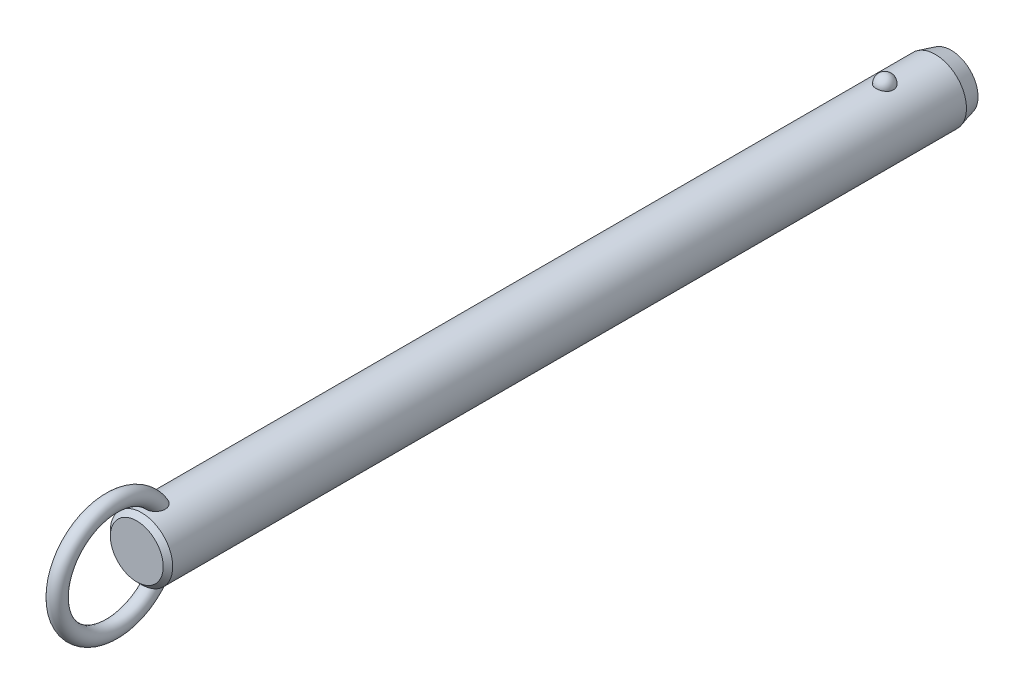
ISO-10303-21;
HEADER;
FILE_DESCRIPTION(('STEP AP214'),'2;1');
FILE_NAME('part.step','',(''),(''),'','','');
FILE_SCHEMA(('AUTOMOTIVE_DESIGN { 1 0 10303 214 1 1 1 1 }'));
ENDSEC;
DATA;
#1=APPLICATION_CONTEXT('core data for automotive mechanical design processes');
#2=APPLICATION_PROTOCOL_DEFINITION('international standard','automotive_design',2000,#1);
#3=PRODUCT_CONTEXT('',#1,'mechanical');
#4=PRODUCT('Part','Part','',(#3));
#5=PRODUCT_RELATED_PRODUCT_CATEGORY('part','',(#4));
#6=PRODUCT_DEFINITION_FORMATION('','',#4);
#7=PRODUCT_DEFINITION_CONTEXT('part definition',#1,'design');
#8=PRODUCT_DEFINITION('design','',#6,#7);
#9=PRODUCT_DEFINITION_SHAPE('','',#8);
#10=(LENGTH_UNIT() NAMED_UNIT(*) SI_UNIT(.MILLI.,.METRE.));
#11=(NAMED_UNIT(*) PLANE_ANGLE_UNIT() SI_UNIT($,.RADIAN.));
#12=(NAMED_UNIT(*) SI_UNIT($,.STERADIAN.) SOLID_ANGLE_UNIT());
#13=UNCERTAINTY_MEASURE_WITH_UNIT(LENGTH_MEASURE(1.E-05),#10,'distance_accuracy_value','');
#14=(GEOMETRIC_REPRESENTATION_CONTEXT(3) GLOBAL_UNCERTAINTY_ASSIGNED_CONTEXT((#13)) GLOBAL_UNIT_ASSIGNED_CONTEXT((#10,
#11,#12)) REPRESENTATION_CONTEXT('',''));
#15=CARTESIAN_POINT('',(0.,0.,0.));
#16=DIRECTION('',(0.,0.,1.));
#17=DIRECTION('',(1.,0.,0.));
#18=AXIS2_PLACEMENT_3D('',#15,#16,#17);
#19=CARTESIAN_POINT('',(0.,0.,177.8));
#20=DIRECTION('',(0.,0.,-1.));
#21=DIRECTION('',(-1.,0.,0.));
#22=AXIS2_PLACEMENT_3D('',#19,#20,#21);
#23=CYLINDRICAL_SURFACE('',#22,7.9);
#24=CARTESIAN_POINT('',(2.1785689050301,7.59367088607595,-2.20000000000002));
#25=CARTESIAN_POINT('',(2.17856679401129,7.59367269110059,-2.07701843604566));
#26=CARTESIAN_POINT('',(2.16853481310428,7.59657145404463,-1.95401006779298));
#27=CARTESIAN_POINT('',(2.12864689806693,7.607843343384,-1.71147811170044));
#28=CARTESIAN_POINT('',(2.09878338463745,7.61621856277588,-1.5919558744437));
#29=CARTESIAN_POINT('',(2.0199931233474,7.63749180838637,-1.35985638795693));
#30=CARTESIAN_POINT('',(1.97107475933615,7.6503878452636,-1.24727610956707));
#31=CARTESIAN_POINT('',(1.85539377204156,7.67926115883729,-1.03213234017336));
#32=CARTESIAN_POINT('',(1.78863158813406,7.69523835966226,-0.929568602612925));
#33=CARTESIAN_POINT('',(1.63856494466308,7.7285848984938,-0.73678633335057));
#34=CARTESIAN_POINT('',(1.55518140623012,7.7459606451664,-0.646630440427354));
#35=CARTESIAN_POINT('',(1.37422937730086,7.78009978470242,-0.481747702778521));
#36=CARTESIAN_POINT('',(1.27666086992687,7.79686317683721,-0.407020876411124));
#37=CARTESIAN_POINT('',(1.07024728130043,7.82786153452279,-0.275278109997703));
#38=CARTESIAN_POINT('',(0.961434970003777,7.84210353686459,-0.218212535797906));
#39=CARTESIAN_POINT('',(0.735351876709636,7.86652194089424,-0.123146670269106));
#40=CARTESIAN_POINT('',(0.618082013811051,7.87669878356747,-0.0851443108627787));
#41=CARTESIAN_POINT('',(0.380637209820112,7.89170521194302,-0.0298158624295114));
#42=CARTESIAN_POINT('',(0.260550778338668,7.89662650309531,-0.0121347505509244));
#43=CARTESIAN_POINT('',(0.0190117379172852,7.90090003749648,0.00324379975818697));
#44=CARTESIAN_POINT('',(-0.102440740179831,7.90025280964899,0.000943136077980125));
#45=CARTESIAN_POINT('',(-0.341452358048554,7.89351056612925,-0.0233955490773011));
#46=CARTESIAN_POINT('',(-0.459042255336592,7.88749257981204,-0.0451545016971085));
#47=CARTESIAN_POINT('',(-0.688796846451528,7.87075812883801,-0.107408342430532));
#48=CARTESIAN_POINT('',(-0.800961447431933,7.86004158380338,-0.14790355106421));
#49=CARTESIAN_POINT('',(-1.01743634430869,7.83497131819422,-0.246799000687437));
#50=CARTESIAN_POINT('',(-1.12169791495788,7.82059709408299,-0.305300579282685));
#51=CARTESIAN_POINT('',(-1.31891765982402,7.78976470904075,-0.43854939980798));
#52=CARTESIAN_POINT('',(-1.41187469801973,7.77330633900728,-0.513298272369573));
#53=CARTESIAN_POINT('',(-1.58577142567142,7.73972434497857,-0.678622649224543));
#54=CARTESIAN_POINT('',(-1.66645140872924,7.72259402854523,-0.769470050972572));
#55=CARTESIAN_POINT('',(-1.81161503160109,7.68983776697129,-0.963538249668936));
#56=CARTESIAN_POINT('',(-1.87609753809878,7.6742119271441,-1.0667599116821));
#57=CARTESIAN_POINT('',(-1.98790138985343,7.6460202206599,-1.28401170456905));
#58=CARTESIAN_POINT('',(-2.03501994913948,7.63349104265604,-1.39815107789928));
#59=CARTESIAN_POINT('',(-2.10986724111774,7.6131449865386,-1.6330178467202));
#60=CARTESIAN_POINT('',(-2.1375965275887,7.60532797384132,-1.75374505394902));
#61=CARTESIAN_POINT('',(-2.17289256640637,7.5953195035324,-1.99782562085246));
#62=CARTESIAN_POINT('',(-2.18054294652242,7.59310471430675,-2.12116592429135));
#63=CARTESIAN_POINT('',(-2.17572919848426,7.59448538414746,-2.36741799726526));
#64=CARTESIAN_POINT('',(-2.1632656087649,7.59808068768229,-2.49032977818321));
#65=CARTESIAN_POINT('',(-2.11865035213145,7.61064035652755,-2.73161015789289));
#66=CARTESIAN_POINT('',(-2.08659579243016,7.61957823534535,-2.84999812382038));
#67=CARTESIAN_POINT('',(-2.00367799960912,7.64179982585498,-3.07955956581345));
#68=CARTESIAN_POINT('',(-1.9528140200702,7.65508371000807,-3.19073275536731));
#69=CARTESIAN_POINT('',(-1.83321113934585,7.68460381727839,-3.40337899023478));
#70=CARTESIAN_POINT('',(-1.76437735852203,7.70085556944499,-3.5047965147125));
#71=CARTESIAN_POINT('',(-1.61069526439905,7.73445734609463,-3.69446912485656));
#72=CARTESIAN_POINT('',(-1.52584634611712,7.75180741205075,-3.78272371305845));
#73=CARTESIAN_POINT('',(-1.34198059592,7.78574608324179,-3.94393987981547));
#74=CARTESIAN_POINT('',(-1.24291308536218,7.80233167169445,-4.01684434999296));
#75=CARTESIAN_POINT('',(-1.03352039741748,7.83281625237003,-4.14489386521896));
#76=CARTESIAN_POINT('',(-0.92319600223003,7.84671543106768,-4.20004014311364));
#77=CARTESIAN_POINT('',(-0.695822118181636,7.87011575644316,-4.29042017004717));
#78=CARTESIAN_POINT('',(-0.578872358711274,7.87966903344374,-4.32589112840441));
#79=CARTESIAN_POINT('',(-0.340410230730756,7.8935652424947,-4.37692226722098));
#80=CARTESIAN_POINT('',(-0.218898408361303,7.89790879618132,-4.39248482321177));
#81=CARTESIAN_POINT('',(0.0228107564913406,7.90087453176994,-4.40314405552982));
#82=CARTESIAN_POINT('',(0.142990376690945,7.89960185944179,-4.39861683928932));
#83=CARTESIAN_POINT('',(0.380829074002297,7.89171262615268,-4.37008293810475));
#84=CARTESIAN_POINT('',(0.498488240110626,7.8850962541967,-4.34607694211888));
#85=CARTESIAN_POINT('',(0.727535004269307,7.86726442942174,-4.27939317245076));
#86=CARTESIAN_POINT('',(0.838944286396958,7.85606616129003,-4.23678512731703));
#87=CARTESIAN_POINT('',(1.05295421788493,7.83025654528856,-4.13408348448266));
#88=CARTESIAN_POINT('',(1.15555431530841,7.81564498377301,-4.07398879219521));
#89=CARTESIAN_POINT('',(1.35076763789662,7.7843022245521,-3.93687432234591));
#90=CARTESIAN_POINT('',(1.4432046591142,7.76754209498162,-3.85961036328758));
#91=CARTESIAN_POINT('',(1.6139111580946,7.73387857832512,-3.69076949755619));
#92=CARTESIAN_POINT('',(1.6921781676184,7.71697516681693,-3.59919010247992));
#93=CARTESIAN_POINT('',(1.83380875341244,7.6845643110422,-3.40247278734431));
#94=CARTESIAN_POINT('',(1.89689280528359,7.66908588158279,-3.29712873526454));
#95=CARTESIAN_POINT('',(2.0047823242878,7.64159441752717,-3.07707931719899));
#96=CARTESIAN_POINT('',(2.0495945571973,7.62958010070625,-2.96237743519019));
#97=CARTESIAN_POINT('',(2.11580183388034,7.61146617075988,-2.74040519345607));
#98=CARTESIAN_POINT('',(2.13929812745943,7.60484503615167,-2.63379846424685));
#99=CARTESIAN_POINT('',(2.17068242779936,7.59594664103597,-2.4181348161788));
#100=CARTESIAN_POINT('',(2.17857077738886,7.59366928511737,-2.30907795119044));
#101=CARTESIAN_POINT('',(2.1785689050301,7.59367088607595,-2.20000000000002));
#102=B_SPLINE_CURVE_WITH_KNOTS('',3,(#24,#25,#26,#27,#28,#29,#30,#31,#32,#33,#34,#35,#36,#37,
#38,#39,#40,#41,#42,#43,#44,#45,#46,#47,#48,#49,#50,#51,#52,#53,#54,#55,#56,#57,#58,#59,#60,#61,
#62,#63,#64,#65,#66,#67,#68,#69,#70,#71,#72,#73,#74,#75,#76,#77,#78,#79,#80,#81,#82,#83,#84,#85,
#86,#87,#88,#89,#90,#91,#92,#93,#94,#95,#96,#97,#98,#99,#100,#101),.UNSPECIFIED.,.T.,.F.,(4,2,2,
2,2,2,2,2,2,2,2,2,2,2,2,2,2,2,2,2,2,2,2,2,2,2,2,2,2,2,2,2,2,2,2,2,2,2,4),(0.,0.368552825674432,
0.737246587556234,1.10577831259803,1.4743009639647,1.8446206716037,2.21494081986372,
2.5842105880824,2.95344028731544,3.31611630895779,3.67875788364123,4.03628044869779,
4.39380913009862,4.75338791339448,5.11300280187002,5.47939989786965,5.8458226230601,
6.21639834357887,6.58696347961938,6.95598276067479,7.32499216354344,7.69218715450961,
8.0593967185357,8.42858578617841,8.79778880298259,9.16834203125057,9.5388695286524,
9.90482699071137,10.2707407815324,10.6298333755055,10.9889132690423,11.3466585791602,
11.7044262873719,12.0676511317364,12.4309391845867,12.8004764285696,13.1698767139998,
13.4967701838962,13.8236564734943),.UNSPECIFIED.);
#103=CARTESIAN_POINT('',(2.1785689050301,7.59367088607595,-2.20000000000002));
#104=VERTEX_POINT('',#103);
#105=EDGE_CURVE('E41',#104,#104,#102,.T.);
#106=ORIENTED_EDGE('',*,*,#105,.T.);
#107=EDGE_LOOP('',(#106));
#108=FACE_BOUND('',#107,.T.);
#109=CARTESIAN_POINT('',(0.,0.,186.12));
#110=DIRECTION('',(0.,0.,1.));
#111=DIRECTION('',(1.,0.,0.));
#112=AXIS2_PLACEMENT_3D('',#109,#110,#111);
#113=CIRCLE('',#112,7.9);
#114=CARTESIAN_POINT('',(7.9,0.,186.12));
#115=VERTEX_POINT('',#114);
#116=EDGE_CURVE('E10',#115,#115,#113,.F.);
#117=ORIENTED_EDGE('',*,*,#116,.T.);
#118=EDGE_LOOP('',(#117));
#119=FACE_BOUND('',#118,.T.);
#120=CARTESIAN_POINT('',(-0.630969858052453,-7.87476203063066,180.012432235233));
#121=CARTESIAN_POINT('',(-0.734180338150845,-7.86648998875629,180.047285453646));
#122=CARTESIAN_POINT('',(-0.83447695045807,-7.85639291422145,180.090816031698));
#123=CARTESIAN_POINT('',(-1.0262035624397,-7.83366343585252,180.194094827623));
#124=CARTESIAN_POINT('',(-1.1176141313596,-7.82102565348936,180.253877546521));
#125=CARTESIAN_POINT('',(-1.28877277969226,-7.79464922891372,180.387839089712));
#126=CARTESIAN_POINT('',(-1.36854014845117,-7.78091246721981,180.461993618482));
#127=CARTESIAN_POINT('',(-1.51461521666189,-7.75380398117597,180.622494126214));
#128=CARTESIAN_POINT('',(-1.58092966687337,-7.74043207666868,180.708833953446));
#129=CARTESIAN_POINT('',(-1.70019064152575,-7.7151252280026,180.892978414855));
#130=CARTESIAN_POINT('',(-1.75284037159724,-7.70322473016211,180.990979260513));
#131=CARTESIAN_POINT('',(-1.84263464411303,-7.68224112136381,181.194102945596));
#132=CARTESIAN_POINT('',(-1.87977299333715,-7.6731591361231,181.299228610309));
#133=CARTESIAN_POINT('',(-1.94152728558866,-7.65777930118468,181.523284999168));
#134=CARTESIAN_POINT('',(-1.96475471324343,-7.65179654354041,181.642616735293));
#135=CARTESIAN_POINT('',(-1.99449499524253,-7.64409642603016,181.88342986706));
#136=CARTESIAN_POINT('',(-2.0010005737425,-7.64238092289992,182.004912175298));
#137=CARTESIAN_POINT('',(-1.99856014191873,-7.64302120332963,182.268340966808));
#138=CARTESIAN_POINT('',(-1.98680021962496,-7.64611845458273,182.41025654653));
#139=CARTESIAN_POINT('',(-1.94457772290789,-7.65696186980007,182.691118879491));
#140=CARTESIAN_POINT('',(-1.91409393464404,-7.66471330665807,182.830062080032));
#141=CARTESIAN_POINT('',(-1.82768670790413,-7.68582947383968,183.131939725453));
#142=CARTESIAN_POINT('',(-1.76772963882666,-7.70003779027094,183.293686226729));
#143=CARTESIAN_POINT('',(-1.65998501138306,-7.72371550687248,183.527695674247));
#144=CARTESIAN_POINT('',(-1.62107967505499,-7.73200670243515,183.604297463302));
#145=CARTESIAN_POINT('',(-1.53727726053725,-7.7491037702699,183.754079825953));
#146=CARTESIAN_POINT('',(-1.49238215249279,-7.75790947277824,183.827261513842));
#147=CARTESIAN_POINT('',(-1.37397050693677,-7.77993338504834,184.00288382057));
#148=CARTESIAN_POINT('',(-1.29690364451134,-7.79328473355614,184.102955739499));
#149=CARTESIAN_POINT('',(-1.12885487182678,-7.81939266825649,184.290714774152));
#150=CARTESIAN_POINT('',(-1.03789926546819,-7.83215032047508,184.378424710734));
#151=CARTESIAN_POINT('',(-0.869532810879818,-7.85231710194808,184.513414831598));
#152=CARTESIAN_POINT('',(-0.795716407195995,-7.86021093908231,184.565076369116));
#153=CARTESIAN_POINT('',(-0.640813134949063,-7.87434920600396,184.656381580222));
#154=CARTESIAN_POINT('',(-0.559737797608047,-7.88059619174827,184.69604389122));
#155=CARTESIAN_POINT('',(-0.406456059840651,-7.88984116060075,184.754300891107));
#156=CARTESIAN_POINT('',(-0.335227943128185,-7.89321892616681,184.775384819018));
#157=CARTESIAN_POINT('',(-0.190193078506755,-7.89804235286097,184.80541418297));
#158=CARTESIAN_POINT('',(-0.116388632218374,-7.89948969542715,184.814370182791));
#159=CARTESIAN_POINT('',(0.0318414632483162,-7.90028409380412,184.819291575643));
#160=CARTESIAN_POINT('',(0.106268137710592,-7.89962640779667,184.815227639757));
#161=CARTESIAN_POINT('',(0.253290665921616,-7.8962818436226,184.794461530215));
#162=CARTESIAN_POINT('',(0.325885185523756,-7.8935935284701,184.777750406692));
#163=CARTESIAN_POINT('',(0.481441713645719,-7.88577340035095,184.728738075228));
#164=CARTESIAN_POINT('',(0.563611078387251,-7.88026321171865,184.694005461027));
#165=CARTESIAN_POINT('',(0.721129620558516,-7.86741729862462,184.611796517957));
#166=CARTESIAN_POINT('',(0.79646633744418,-7.86007832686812,184.564297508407));
#167=CARTESIAN_POINT('',(0.971456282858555,-7.84073285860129,184.436513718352));
#168=CARTESIAN_POINT('',(1.06719686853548,-7.82809461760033,184.351004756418));
#169=CARTESIAN_POINT('',(1.24418921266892,-7.80192439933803,184.166232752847));
#170=CARTESIAN_POINT('',(1.32540832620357,-7.78839049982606,184.066939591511));
#171=CARTESIAN_POINT('',(1.45199971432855,-7.76559693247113,183.889576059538));
#172=CARTESIAN_POINT('',(1.50085649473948,-7.75626094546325,183.813954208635));
#173=CARTESIAN_POINT('',(1.59197749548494,-7.73807279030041,183.658742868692));
#174=CARTESIAN_POINT('',(1.63423919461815,-7.72922080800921,183.579151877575));
#175=CARTESIAN_POINT('',(1.71222612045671,-7.71231959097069,183.416664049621));
#176=CARTESIAN_POINT('',(1.74794516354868,-7.70427111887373,183.333764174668));
#177=CARTESIAN_POINT('',(1.81270113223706,-7.68929240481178,183.165296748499));
#178=CARTESIAN_POINT('',(1.84173789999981,-7.68236218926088,183.079729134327));
#179=CARTESIAN_POINT('',(1.89322698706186,-7.6698375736,182.90528702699));
#180=CARTESIAN_POINT('',(1.91558744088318,-7.66426199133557,182.816383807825));
#181=CARTESIAN_POINT('',(1.95281367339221,-7.65485915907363,182.636969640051));
#182=CARTESIAN_POINT('',(1.96767946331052,-7.65103190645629,182.546458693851));
#183=CARTESIAN_POINT('',(2.0002145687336,-7.64262981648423,182.273732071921));
#184=CARTESIAN_POINT('',(2.00600691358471,-7.6410871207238,182.089709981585));
#185=CARTESIAN_POINT('',(1.98445334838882,-7.64669564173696,181.776501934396));
#186=CARTESIAN_POINT('',(1.96607186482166,-7.65149688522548,181.646618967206));
#187=CARTESIAN_POINT('',(1.90884967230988,-7.66597624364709,181.391632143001));
#188=CARTESIAN_POINT('',(1.87002101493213,-7.67565148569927,181.266525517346));
#189=CARTESIAN_POINT('',(1.77063986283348,-7.69918471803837,181.02454013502));
#190=CARTESIAN_POINT('',(1.70993724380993,-7.71307150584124,180.907725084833));
#191=CARTESIAN_POINT('',(1.56733070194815,-7.74330306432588,180.688144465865));
#192=CARTESIAN_POINT('',(1.48543692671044,-7.75964665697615,180.585372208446));
#193=CARTESIAN_POINT('',(1.31346177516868,-7.79047523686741,180.409380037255));
#194=CARTESIAN_POINT('',(1.22547278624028,-7.80495298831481,180.334106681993));
#195=CARTESIAN_POINT('',(1.03724352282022,-7.83218597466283,180.200486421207));
#196=CARTESIAN_POINT('',(0.93700840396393,-7.84494192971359,180.142132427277));
#197=CARTESIAN_POINT('',(0.733599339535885,-7.86649045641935,180.047027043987));
#198=CARTESIAN_POINT('',(0.630941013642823,-7.87547134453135,180.009210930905));
#199=CARTESIAN_POINT('',(0.420465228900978,-7.88950708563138,179.951116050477));
#200=CARTESIAN_POINT('',(0.312645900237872,-7.89456050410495,179.93084369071));
#201=CARTESIAN_POINT('',(0.096086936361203,-7.9001518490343,179.908455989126));
#202=CARTESIAN_POINT('',(-0.0126341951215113,-7.90073226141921,179.906169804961));
#203=CARTESIAN_POINT('',(-0.228766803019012,-7.89742350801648,179.919367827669));
#204=CARTESIAN_POINT('',(-0.336180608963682,-7.89354403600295,179.934813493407));
#205=CARTESIAN_POINT('',(-0.473410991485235,-7.88586871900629,179.966217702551));
#206=CARTESIAN_POINT('',(-0.50525779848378,-7.88388984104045,179.974354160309));
#207=CARTESIAN_POINT('',(-0.56848128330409,-7.87958326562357,179.992208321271));
#208=CARTESIAN_POINT('',(-0.59985795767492,-7.87725556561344,180.001926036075));
#209=CARTESIAN_POINT('',(-0.630969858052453,-7.87476203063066,180.012432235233));
#210=B_SPLINE_CURVE_WITH_KNOTS('',3,(#120,#121,#122,#123,#124,#125,#126,#127,#128,#129,#130,
#131,#132,#133,#134,#135,#136,#137,#138,#139,#140,#141,#142,#143,#144,#145,#146,#147,#148,#149,
#150,#151,#152,#153,#154,#155,#156,#157,#158,#159,#160,#161,#162,#163,#164,#165,#166,#167,#168,
#169,#170,#171,#172,#173,#174,#175,#176,#177,#178,#179,#180,#181,#182,#183,#184,#185,#186,#187,
#188,#189,#190,#191,#192,#193,#194,#195,#196,#197,#198,#199,#200,#201,#202,#203,#204,#205,#206,
#207,#208,#209),.UNSPECIFIED.,.T.,.F.,(4,2,2,2,2,2,2,2,2,2,2,2,2,2,2,2,2,2,2,2,2,2,2,2,2,2,2,2,
2,2,2,2,2,2,2,2,2,2,2,2,2,2,2,2,4),(0.,0.327622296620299,0.655945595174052,0.983718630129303,
1.3113267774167,1.64554655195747,1.97989964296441,2.34365728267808,2.70757317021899,
3.13333684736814,3.5595838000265,4.07655306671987,4.33527897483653,4.59391999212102,
4.97382437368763,5.353017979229,5.62348245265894,5.89352465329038,6.11565959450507,
6.33760092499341,6.56004255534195,6.78264174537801,7.04930844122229,7.31645206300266,
7.70130871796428,8.08701995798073,8.35824509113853,8.6295736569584,8.9011573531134,
9.1727474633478,9.44791855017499,9.72308922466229,10.2715298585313,10.6638393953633,
11.0559179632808,11.4507403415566,11.8453740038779,12.1936425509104,12.5417649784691,
12.8695063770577,13.1973674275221,13.5221104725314,13.8461490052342,13.9449071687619,
14.0436660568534),.UNSPECIFIED.);
#211=CARTESIAN_POINT('',(-0.630969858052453,-7.87476203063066,180.012432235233));
#212=VERTEX_POINT('',#211);
#213=EDGE_CURVE('E60',#212,#212,#210,.T.);
#214=ORIENTED_EDGE('',*,*,#213,.T.);
#215=EDGE_LOOP('',(#214));
#216=FACE_BOUND('',#215,.T.);
#217=CARTESIAN_POINT('',(-0.630969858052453,7.87476203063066,180.012432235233));
#218=CARTESIAN_POINT('',(-0.528918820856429,7.88293636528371,179.977979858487));
#219=CARTESIAN_POINT('',(-0.423745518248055,7.88934810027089,179.951915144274));
#220=CARTESIAN_POINT('',(-0.210236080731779,7.8979273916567,179.917282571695));
#221=CARTESIAN_POINT('',(-0.10189380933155,7.90008607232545,179.908751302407));
#222=CARTESIAN_POINT('',(0.114660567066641,7.89990877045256,179.909457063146));
#223=CARTESIAN_POINT('',(0.222872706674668,7.89757640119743,179.91867980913));
#224=CARTESIAN_POINT('',(0.436107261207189,7.88867538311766,179.954652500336));
#225=CARTESIAN_POINT('',(0.541131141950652,7.8821087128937,179.98139425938));
#226=CARTESIAN_POINT('',(0.745085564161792,7.86545130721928,180.051756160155));
#227=CARTESIAN_POINT('',(0.844015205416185,7.85536005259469,180.095378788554));
#228=CARTESIAN_POINT('',(1.03299167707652,7.83275153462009,180.198379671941));
#229=CARTESIAN_POINT('',(1.12303841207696,7.8202342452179,180.257758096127));
#230=CARTESIAN_POINT('',(1.29214734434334,7.79408219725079,180.390864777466));
#231=CARTESIAN_POINT('',(1.37116907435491,7.78044359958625,180.464643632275));
#232=CARTESIAN_POINT('',(1.51597677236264,7.75353170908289,180.624235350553));
#233=CARTESIAN_POINT('',(1.58176261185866,7.74025841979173,180.710048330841));
#234=CARTESIAN_POINT('',(1.70057386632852,7.71504069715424,180.893644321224));
#235=CARTESIAN_POINT('',(1.75320073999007,7.7031425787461,180.991690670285));
#236=CARTESIAN_POINT('',(1.8429376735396,7.68216822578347,181.194893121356));
#237=CARTESIAN_POINT('',(1.88004278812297,7.67309289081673,181.300051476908));
#238=CARTESIAN_POINT('',(1.9417232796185,7.6577294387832,181.524167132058));
#239=CARTESIAN_POINT('',(1.96491037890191,7.65175648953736,181.643524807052));
#240=CARTESIAN_POINT('',(1.9945689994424,7.64407702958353,181.884384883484));
#241=CARTESIAN_POINT('',(2.00103304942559,7.64237242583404,182.00588821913));
#242=CARTESIAN_POINT('',(1.99850166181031,7.64303650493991,182.269368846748));
#243=CARTESIAN_POINT('',(1.98669038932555,7.64614714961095,182.411314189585));
#244=CARTESIAN_POINT('',(1.94436120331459,7.6570170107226,182.692228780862));
#245=CARTESIAN_POINT('',(1.91382203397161,7.66478150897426,182.831194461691));
#246=CARTESIAN_POINT('',(1.82728754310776,7.68592483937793,183.133111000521));
#247=CARTESIAN_POINT('',(1.76725778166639,7.7001468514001,183.294872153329));
#248=CARTESIAN_POINT('',(1.65939700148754,7.72384204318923,183.528891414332));
#249=CARTESIAN_POINT('',(1.62045187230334,7.73213852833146,183.605494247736));
#250=CARTESIAN_POINT('',(1.53656684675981,7.74924489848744,183.755273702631));
#251=CARTESIAN_POINT('',(1.49162892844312,7.75805461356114,183.828451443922));
#252=CARTESIAN_POINT('',(1.37317698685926,7.78007342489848,184.003952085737));
#253=CARTESIAN_POINT('',(1.29612360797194,7.79341423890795,184.103911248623));
#254=CARTESIAN_POINT('',(1.12812043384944,7.81949839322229,184.29145083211));
#255=CARTESIAN_POINT('',(1.03719688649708,7.83224280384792,184.379054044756));
#256=CARTESIAN_POINT('',(0.868871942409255,7.85239026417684,184.51389715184));
#257=CARTESIAN_POINT('',(0.795056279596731,7.86027769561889,184.565511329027));
#258=CARTESIAN_POINT('',(0.640160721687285,7.87440222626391,184.656720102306));
#259=CARTESIAN_POINT('',(0.559092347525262,7.88064188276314,184.696333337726));
#260=CARTESIAN_POINT('',(0.405820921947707,7.8898738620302,184.754505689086));
#261=CARTESIAN_POINT('',(0.334594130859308,7.89324577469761,184.775552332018));
#262=CARTESIAN_POINT('',(0.189568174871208,7.89805733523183,184.805507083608));
#263=CARTESIAN_POINT('',(0.115771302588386,7.89949866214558,184.814425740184));
#264=CARTESIAN_POINT('',(-0.0324359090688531,7.90028156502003,184.81927589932));
#265=CARTESIAN_POINT('',(-0.106847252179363,7.89961843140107,184.815178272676));
#266=CARTESIAN_POINT('',(-0.253834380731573,7.8962642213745,184.794351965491));
#267=CARTESIAN_POINT('',(-0.326408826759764,7.89357170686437,184.777614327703));
#268=CARTESIAN_POINT('',(-0.481962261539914,7.88574179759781,184.728539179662));
#269=CARTESIAN_POINT('',(-0.564145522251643,7.88022507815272,184.693763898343));
#270=CARTESIAN_POINT('',(-0.721685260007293,7.86736646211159,184.611468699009));
#271=CARTESIAN_POINT('',(-0.797029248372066,7.8600213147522,184.563926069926));
#272=CARTESIAN_POINT('',(-0.9720442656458,7.84066026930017,184.436026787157));
#273=CARTESIAN_POINT('',(-1.06779803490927,7.82801274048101,184.350443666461));
#274=CARTESIAN_POINT('',(-1.2448053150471,7.80182621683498,184.165522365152));
#275=CARTESIAN_POINT('',(-1.32602618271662,7.78828530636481,184.066154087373));
#276=CARTESIAN_POINT('',(-1.45259834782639,7.76548487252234,183.888680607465));
#277=CARTESIAN_POINT('',(-1.50143856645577,7.75614818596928,183.813025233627));
#278=CARTESIAN_POINT('',(-1.59252410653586,7.73796020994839,183.657748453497));
#279=CARTESIAN_POINT('',(-1.63476690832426,7.72910910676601,183.578125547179));
#280=CARTESIAN_POINT('',(-1.71271318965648,7.71221133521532,183.415575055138));
#281=CARTESIAN_POINT('',(-1.74841047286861,7.70416543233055,183.332644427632));
#282=CARTESIAN_POINT('',(-1.81311929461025,7.6891937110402,183.164116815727));
#283=CARTESIAN_POINT('',(-1.84213067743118,7.68226791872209,183.078519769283));
#284=CARTESIAN_POINT('',(-1.89356259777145,7.66975461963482,182.904025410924));
#285=CARTESIAN_POINT('',(-1.91589165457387,7.66418586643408,182.815099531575));
#286=CARTESIAN_POINT('',(-1.9530507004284,7.65479859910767,182.635642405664));
#287=CARTESIAN_POINT('',(-1.96788069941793,7.65098008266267,182.545111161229));
#288=CARTESIAN_POINT('',(-2.00030078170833,7.64260704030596,182.272327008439));
#289=CARTESIAN_POINT('',(-2.00600576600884,7.64108760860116,182.088271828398));
#290=CARTESIAN_POINT('',(-1.9842848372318,7.64673945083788,181.775080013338));
#291=CARTESIAN_POINT('',(-1.96583698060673,7.65155751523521,181.645240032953));
#292=CARTESIAN_POINT('',(-1.90848948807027,7.66606613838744,181.390361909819));
#293=CARTESIAN_POINT('',(-1.86960376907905,7.67575338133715,181.265320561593));
#294=CARTESIAN_POINT('',(-1.77013421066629,7.6993013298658,181.023500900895));
#295=CARTESIAN_POINT('',(-1.70940488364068,7.71318991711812,180.906784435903));
#296=CARTESIAN_POINT('',(-1.56672953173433,7.74342495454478,180.687340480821));
#297=CARTESIAN_POINT('',(-1.48478316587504,7.75977144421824,180.58461321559));
#298=CARTESIAN_POINT('',(-1.31266325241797,7.79061163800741,180.408643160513));
#299=CARTESIAN_POINT('',(-1.22456383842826,7.80509908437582,180.333358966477));
#300=CARTESIAN_POINT('',(-1.03622400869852,7.83231881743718,180.199865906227));
#301=CARTESIAN_POINT('',(-0.936015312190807,7.84505551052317,180.141613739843));
#302=CARTESIAN_POINT('',(-0.798824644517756,7.85957802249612,180.077540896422));
#303=CARTESIAN_POINT('',(-0.765787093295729,7.86286821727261,180.063224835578));
#304=CARTESIAN_POINT('',(-0.698939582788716,7.86909211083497,180.036436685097));
#305=CARTESIAN_POINT('',(-0.66512963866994,7.8720258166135,180.023964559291));
#306=CARTESIAN_POINT('',(-0.630969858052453,7.87476203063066,180.012432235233));
#307=B_SPLINE_CURVE_WITH_KNOTS('',3,(#217,#218,#219,#220,#221,#222,#223,#224,#225,#226,#227,
#228,#229,#230,#231,#232,#233,#234,#235,#236,#237,#238,#239,#240,#241,#242,#243,#244,#245,#246,
#247,#248,#249,#250,#251,#252,#253,#254,#255,#256,#257,#258,#259,#260,#261,#262,#263,#264,#265,
#266,#267,#268,#269,#270,#271,#272,#273,#274,#275,#276,#277,#278,#279,#280,#281,#282,#283,#284,
#285,#286,#287,#288,#289,#290,#291,#292,#293,#294,#295,#296,#297,#298,#299,#300,#301,#302,#303,
#304,#305,#306),.UNSPECIFIED.,.T.,.F.,(4,2,2,2,2,2,2,2,2,2,2,2,2,2,2,2,2,2,2,2,2,2,2,2,2,2,2,2,
2,2,2,2,2,2,2,2,2,2,2,2,2,2,2,2,4),(0.,0.323920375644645,0.648516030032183,0.972850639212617,
1.29703380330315,1.62126473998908,1.94549915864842,2.27089401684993,2.5962920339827,
2.93059633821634,3.26500707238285,3.6288164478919,3.99278833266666,4.4186542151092,
4.84500434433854,5.36209210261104,5.62087589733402,5.87957448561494,6.25918598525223,
6.63808782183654,6.90846748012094,7.17842501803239,7.40052350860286,7.6224287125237,
7.84483086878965,8.06739077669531,8.33414615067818,8.60137921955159,8.98641454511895,
9.37230415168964,9.64358673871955,9.91497268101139,10.1866142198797,10.4582620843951,
10.7334745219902,11.008686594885,11.5572126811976,11.9494246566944,12.3413699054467,
12.7359755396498,13.1305875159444,13.4791770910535,13.82687259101,13.9353013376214,
14.0437279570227),.UNSPECIFIED.);
#308=CARTESIAN_POINT('',(-0.630969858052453,7.87476203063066,180.012432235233));
#309=VERTEX_POINT('',#308);
#310=EDGE_CURVE('E68',#309,#309,#307,.T.);
#311=ORIENTED_EDGE('',*,*,#310,.T.);
#312=EDGE_LOOP('',(#311));
#313=FACE_BOUND('',#312,.T.);
#314=CARTESIAN_POINT('',(0.,0.,-15.));
#315=DIRECTION('',(0.,0.,-1.));
#316=DIRECTION('',(-1.,0.,0.));
#317=AXIS2_PLACEMENT_3D('',#314,#315,#316);
#318=CIRCLE('',#317,7.9);
#319=CARTESIAN_POINT('',(-7.9,0.,-15.));
#320=VERTEX_POINT('',#319);
#321=EDGE_CURVE('E57',#320,#320,#318,.F.);
#322=ORIENTED_EDGE('',*,*,#321,.T.);
#323=EDGE_LOOP('',(#322));
#324=FACE_BOUND('',#323,.T.);
#325=ADVANCED_FACE('F37',(#108,#119,#216,#313,#324),#23,.T.);
#326=CARTESIAN_POINT('',(0.,0.,-19.));
#327=DIRECTION('',(0.,0.,-1.));
#328=DIRECTION('',(-1.,0.,0.));
#329=AXIS2_PLACEMENT_3D('',#326,#327,#328);
#330=PLANE('',#329);
#331=CARTESIAN_POINT('',(0.,0.,-19.));
#332=DIRECTION('',(0.,0.,-1.));
#333=DIRECTION('',(-1.,0.,0.));
#334=AXIS2_PLACEMENT_3D('',#331,#332,#333);
#335=CIRCLE('',#334,6.82820323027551);
#336=CARTESIAN_POINT('',(-6.82820323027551,0.,-19.));
#337=VERTEX_POINT('',#336);
#338=EDGE_CURVE('E67',#337,#337,#335,.T.);
#339=ORIENTED_EDGE('',*,*,#338,.T.);
#340=EDGE_LOOP('',(#339));
#341=FACE_BOUND('',#340,.T.);
#342=ADVANCED_FACE('F86',(#341),#330,.T.);
#343=CARTESIAN_POINT('',(0.,0.,-19.));
#344=DIRECTION('',(0.,0.,1.));
#345=DIRECTION('',(1.,0.,0.));
#346=AXIS2_PLACEMENT_3D('',#343,#344,#345);
#347=CONICAL_SURFACE('',#346,6.82820323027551,0.261799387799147);
#348=ORIENTED_EDGE('',*,*,#321,.F.);
#349=EDGE_LOOP('',(#348));
#350=FACE_BOUND('',#349,.T.);
#351=ORIENTED_EDGE('',*,*,#338,.F.);
#352=EDGE_LOOP('',(#351));
#353=FACE_BOUND('',#352,.T.);
#354=ADVANCED_FACE('F84',(#350,#353),#347,.T.);
#355=CARTESIAN_POINT('',(0.,0.,187.32));
#356=DIRECTION('',(0.,0.,1.));
#357=DIRECTION('',(1.,0.,0.));
#358=AXIS2_PLACEMENT_3D('',#355,#356,#357);
#359=PLANE('',#358);
#360=CARTESIAN_POINT('',(0.,0.,187.32));
#361=DIRECTION('',(0.,0.,1.));
#362=DIRECTION('',(1.,0.,0.));
#363=AXIS2_PLACEMENT_3D('',#360,#361,#362);
#364=CIRCLE('',#363,6.70000000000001);
#365=CARTESIAN_POINT('',(6.70000000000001,0.,187.32));
#366=VERTEX_POINT('',#365);
#367=EDGE_CURVE('E50',#366,#366,#364,.T.);
#368=ORIENTED_EDGE('',*,*,#367,.T.);
#369=EDGE_LOOP('',(#368));
#370=FACE_BOUND('',#369,.T.);
#371=ADVANCED_FACE('F78',(#370),#359,.T.);
#372=CARTESIAN_POINT('',(0.,0.,193.65));
#373=DIRECTION('',(1.,0.,0.));
#374=DIRECTION('',(0.,0.,-1.));
#375=AXIS2_PLACEMENT_3D('',#372,#373,#374);
#376=TOROIDAL_SURFACE('',#375,13.85,2.);
#377=ORIENTED_EDGE('',*,*,#310,.F.);
#378=EDGE_LOOP('',(#377));
#379=FACE_BOUND('',#378,.T.);
#380=ORIENTED_EDGE('',*,*,#213,.F.);
#381=EDGE_LOOP('',(#380));
#382=FACE_BOUND('',#381,.T.);
#383=ADVANCED_FACE('F74',(#379,#382),#376,.T.);
#384=CARTESIAN_POINT('',(0.,0.,187.32));
#385=DIRECTION('',(0.,0.,-1.));
#386=DIRECTION('',(-1.,0.,0.));
#387=AXIS2_PLACEMENT_3D('',#384,#385,#386);
#388=CONICAL_SURFACE('',#387,6.70000000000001,0.785398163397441);
#389=ORIENTED_EDGE('',*,*,#116,.F.);
#390=EDGE_LOOP('',(#389));
#391=FACE_BOUND('',#390,.T.);
#392=ORIENTED_EDGE('',*,*,#367,.F.);
#393=EDGE_LOOP('',(#392));
#394=FACE_BOUND('',#393,.T.);
#395=ADVANCED_FACE('F39',(#391,#394),#388,.T.);
#396=CARTESIAN_POINT('',(0.,7.9,-2.20000000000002));
#397=DIRECTION('',(0.,1.,0.));
#398=DIRECTION('',(0.,0.,-1.));
#399=AXIS2_PLACEMENT_3D('',#396,#397,#398);
#400=SPHERICAL_SURFACE('',#399,2.2);
#401=ORIENTED_EDGE('',*,*,#105,.F.);
#402=EDGE_LOOP('',(#401));
#403=FACE_BOUND('',#402,.T.);
#404=ADVANCED_FACE('F80',(#403),#400,.T.);
#405=CLOSED_SHELL('',(#325,#342,#354,#371,#383,#395,#404));
#406=MANIFOLD_SOLID_BREP('B2',#405);
#407=ADVANCED_BREP_SHAPE_REPRESENTATION('',(#18,#406),#14);
#408=SHAPE_DEFINITION_REPRESENTATION(#9,#407);
ENDSEC;
END-ISO-10303-21;
